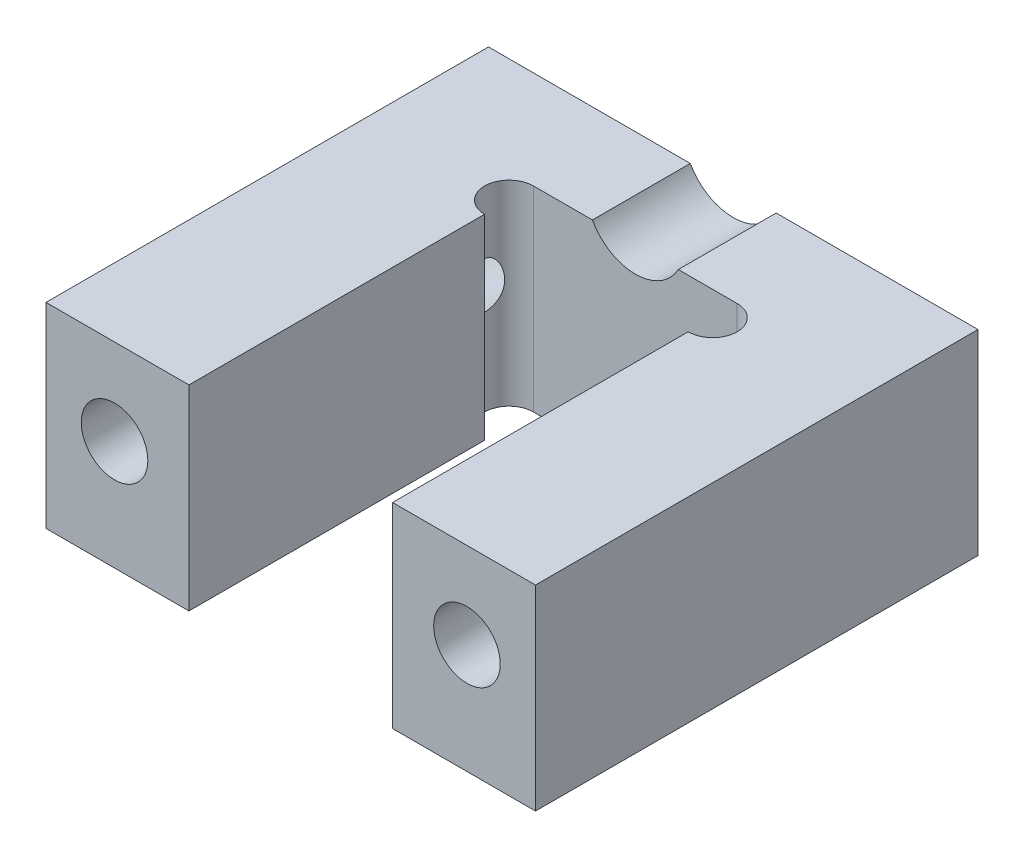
ISO-10303-21;
HEADER;
FILE_DESCRIPTION(('STEP AP214'),'2;1');
FILE_NAME('part.step','',(''),(''),'','','');
FILE_SCHEMA(('AUTOMOTIVE_DESIGN { 1 0 10303 214 1 1 1 1 }'));
ENDSEC;
DATA;
#1=APPLICATION_CONTEXT('core data for automotive mechanical design processes');
#2=APPLICATION_PROTOCOL_DEFINITION('international standard','automotive_design',2000,#1);
#3=PRODUCT_CONTEXT('',#1,'mechanical');
#4=PRODUCT('Part','Part','',(#3));
#5=PRODUCT_RELATED_PRODUCT_CATEGORY('part','',(#4));
#6=PRODUCT_DEFINITION_FORMATION('','',#4);
#7=PRODUCT_DEFINITION_CONTEXT('part definition',#1,'design');
#8=PRODUCT_DEFINITION('design','',#6,#7);
#9=PRODUCT_DEFINITION_SHAPE('','',#8);
#10=(LENGTH_UNIT() NAMED_UNIT(*) SI_UNIT(.MILLI.,.METRE.));
#11=(NAMED_UNIT(*) PLANE_ANGLE_UNIT() SI_UNIT($,.RADIAN.));
#12=(NAMED_UNIT(*) SI_UNIT($,.STERADIAN.) SOLID_ANGLE_UNIT());
#13=UNCERTAINTY_MEASURE_WITH_UNIT(LENGTH_MEASURE(1.E-05),#10,'distance_accuracy_value','');
#14=(GEOMETRIC_REPRESENTATION_CONTEXT(3) GLOBAL_UNCERTAINTY_ASSIGNED_CONTEXT((#13)) GLOBAL_UNIT_ASSIGNED_CONTEXT((#10,
#11,#12)) REPRESENTATION_CONTEXT('',''));
#15=CARTESIAN_POINT('',(0.,0.,0.));
#16=DIRECTION('',(0.,0.,1.));
#17=DIRECTION('',(1.,0.,0.));
#18=AXIS2_PLACEMENT_3D('',#15,#16,#17);
#19=CARTESIAN_POINT('',(0.,12.7,28.702));
#20=DIRECTION('',(0.,-1.,0.));
#21=DIRECTION('',(0.,0.,-1.));
#22=AXIS2_PLACEMENT_3D('',#19,#20,#21);
#23=PLANE('',#22);
#24=DIRECTION('',(-1.,0.,0.));
#25=VECTOR('',#24,1.);
#26=CARTESIAN_POINT('',(9.27099999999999,12.7,6.34999999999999));
#27=LINE('',#26,#25);
#28=CARTESIAN_POINT('',(13.0896725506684,12.7,6.34999999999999));
#29=VERTEX_POINT('',#28);
#30=CARTESIAN_POINT('',(9.27099999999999,12.7,6.34999999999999));
#31=VERTEX_POINT('',#30);
#32=EDGE_CURVE('E274',#29,#31,#27,.T.);
#33=ORIENTED_EDGE('',*,*,#32,.F.);
#34=DIRECTION('',(0.,0.,-1.));
#35=VECTOR('',#34,1.);
#36=CARTESIAN_POINT('',(13.0896725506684,12.7,12.7));
#37=LINE('',#36,#35);
#38=CARTESIAN_POINT('',(13.0896725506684,12.7,0.));
#39=VERTEX_POINT('',#38);
#40=EDGE_CURVE('E49',#29,#39,#37,.T.);
#41=ORIENTED_EDGE('',*,*,#40,.T.);
#42=DIRECTION('',(-1.,0.,0.));
#43=VECTOR('',#42,1.);
#44=CARTESIAN_POINT('',(0.,12.7,0.));
#45=LINE('',#44,#43);
#46=CARTESIAN_POINT('',(0.,12.7,0.));
#47=VERTEX_POINT('',#46);
#48=EDGE_CURVE('E139',#39,#47,#45,.T.);
#49=ORIENTED_EDGE('',*,*,#48,.T.);
#50=DIRECTION('',(0.,0.,-1.));
#51=VECTOR('',#50,1.);
#52=CARTESIAN_POINT('',(0.,12.7,28.702));
#53=LINE('',#52,#51);
#54=CARTESIAN_POINT('',(0.,12.7,28.702));
#55=VERTEX_POINT('',#54);
#56=EDGE_CURVE('E164',#55,#47,#53,.T.);
#57=ORIENTED_EDGE('',*,*,#56,.F.);
#58=DIRECTION('',(-1.,0.,0.));
#59=VECTOR('',#58,1.);
#60=CARTESIAN_POINT('',(0.,12.7,28.702));
#61=LINE('',#60,#59);
#62=CARTESIAN_POINT('',(9.271,12.7,28.702));
#63=VERTEX_POINT('',#62);
#64=EDGE_CURVE('E160',#63,#55,#61,.T.);
#65=ORIENTED_EDGE('',*,*,#64,.F.);
#66=DIRECTION('',(0.,0.,1.));
#67=VECTOR('',#66,1.);
#68=CARTESIAN_POINT('',(9.27099999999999,12.7,6.34999999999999));
#69=LINE('',#68,#67);
#70=CARTESIAN_POINT('',(9.27099999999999,12.7,9.525));
#71=VERTEX_POINT('',#70);
#72=EDGE_CURVE('E56',#71,#63,#69,.T.);
#73=ORIENTED_EDGE('',*,*,#72,.F.);
#74=CARTESIAN_POINT('',(9.27099999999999,12.7,7.93749999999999));
#75=DIRECTION('',(0.,1.,0.));
#76=DIRECTION('',(0.,0.,-1.));
#77=AXIS2_PLACEMENT_3D('',#74,#75,#76);
#78=CIRCLE('',#77,1.5875);
#79=EDGE_CURVE('E302',#31,#71,#78,.T.);
#80=ORIENTED_EDGE('',*,*,#79,.F.);
#81=EDGE_LOOP('',(#33,#41,#49,#57,#65,#73,#80));
#82=FACE_BOUND('',#81,.T.);
#83=ADVANCED_FACE('F34',(#82),#23,.F.);
#84=CARTESIAN_POINT('',(4.445,7.112,28.702));
#85=DIRECTION('',(0.,0.,-1.));
#86=DIRECTION('',(-1.,0.,0.));
#87=AXIS2_PLACEMENT_3D('',#84,#85,#86);
#88=CYLINDRICAL_SURFACE('',#87,2.159);
#89=CARTESIAN_POINT('',(4.445,7.112,28.702));
#90=DIRECTION('',(0.,0.,-1.));
#91=DIRECTION('',(1.,0.,0.));
#92=AXIS2_PLACEMENT_3D('',#89,#90,#91);
#93=CIRCLE('',#92,2.159);
#94=CARTESIAN_POINT('',(6.604,7.112,28.702));
#95=VERTEX_POINT('',#94);
#96=EDGE_CURVE('E176',#95,#95,#93,.T.);
#97=ORIENTED_EDGE('',*,*,#96,.F.);
#98=EDGE_LOOP('',(#97));
#99=FACE_BOUND('',#98,.T.);
#100=CARTESIAN_POINT('',(4.445,7.112,17.78));
#101=DIRECTION('',(0.,0.,-1.));
#102=DIRECTION('',(-1.,0.,0.));
#103=AXIS2_PLACEMENT_3D('',#100,#101,#102);
#104=CIRCLE('',#103,2.159);
#105=CARTESIAN_POINT('',(2.286,7.112,17.78));
#106=VERTEX_POINT('',#105);
#107=EDGE_CURVE('E178',#106,#106,#104,.F.);
#108=ORIENTED_EDGE('',*,*,#107,.F.);
#109=EDGE_LOOP('',(#108));
#110=FACE_BOUND('',#109,.T.);
#111=ADVANCED_FACE('F222',(#99,#110),#88,.F.);
#112=CARTESIAN_POINT('',(27.305,7.112,28.702));
#113=DIRECTION('',(0.,0.,-1.));
#114=DIRECTION('',(-1.,0.,0.));
#115=AXIS2_PLACEMENT_3D('',#112,#113,#114);
#116=CYLINDRICAL_SURFACE('',#115,2.159);
#117=CARTESIAN_POINT('',(27.305,7.112,28.702));
#118=DIRECTION('',(0.,0.,-1.));
#119=DIRECTION('',(-1.,0.,0.));
#120=AXIS2_PLACEMENT_3D('',#117,#118,#119);
#121=CIRCLE('',#120,2.159);
#122=CARTESIAN_POINT('',(25.146,7.112,28.702));
#123=VERTEX_POINT('',#122);
#124=EDGE_CURVE('E280',#123,#123,#121,.T.);
#125=ORIENTED_EDGE('',*,*,#124,.F.);
#126=EDGE_LOOP('',(#125));
#127=FACE_BOUND('',#126,.T.);
#128=CARTESIAN_POINT('',(27.305,7.112,17.78));
#129=DIRECTION('',(0.,0.,-1.));
#130=DIRECTION('',(-1.,0.,0.));
#131=AXIS2_PLACEMENT_3D('',#128,#129,#130);
#132=CIRCLE('',#131,2.159);
#133=CARTESIAN_POINT('',(25.146,7.112,17.78));
#134=VERTEX_POINT('',#133);
#135=EDGE_CURVE('E173',#134,#134,#132,.F.);
#136=ORIENTED_EDGE('',*,*,#135,.F.);
#137=EDGE_LOOP('',(#136));
#138=FACE_BOUND('',#137,.T.);
#139=ADVANCED_FACE('F228',(#127,#138),#116,.F.);
#140=CARTESIAN_POINT('',(0.,12.7,28.702));
#141=DIRECTION('',(0.,0.,-1.));
#142=DIRECTION('',(-1.,0.,0.));
#143=AXIS2_PLACEMENT_3D('',#140,#141,#142);
#144=PLANE('',#143);
#145=ORIENTED_EDGE('',*,*,#124,.T.);
#146=EDGE_LOOP('',(#145));
#147=FACE_BOUND('',#146,.T.);
#148=CARTESIAN_POINT('',(31.75,12.7,28.702));
#149=VERTEX_POINT('',#148);
#150=CARTESIAN_POINT('',(22.479,12.7,28.702));
#151=VERTEX_POINT('',#150);
#152=EDGE_CURVE('E161',#149,#151,#61,.T.);
#153=ORIENTED_EDGE('',*,*,#152,.T.);
#154=DIRECTION('',(0.,1.,0.));
#155=VECTOR('',#154,1.);
#156=CARTESIAN_POINT('',(22.479,12.7,28.702));
#157=LINE('',#156,#155);
#158=CARTESIAN_POINT('',(22.479,0.,28.702));
#159=VERTEX_POINT('',#158);
#160=EDGE_CURVE('E275',#159,#151,#157,.T.);
#161=ORIENTED_EDGE('',*,*,#160,.F.);
#162=DIRECTION('',(1.,0.,0.));
#163=VECTOR('',#162,1.);
#164=CARTESIAN_POINT('',(0.,0.,28.702));
#165=LINE('',#164,#163);
#166=CARTESIAN_POINT('',(31.75,0.,28.702));
#167=VERTEX_POINT('',#166);
#168=EDGE_CURVE('E149',#159,#167,#165,.T.);
#169=ORIENTED_EDGE('',*,*,#168,.T.);
#170=DIRECTION('',(0.,1.,0.));
#171=VECTOR('',#170,1.);
#172=CARTESIAN_POINT('',(31.75,0.,28.702));
#173=LINE('',#172,#171);
#174=EDGE_CURVE('E158',#167,#149,#173,.T.);
#175=ORIENTED_EDGE('',*,*,#174,.T.);
#176=EDGE_LOOP('',(#153,#161,#169,#175));
#177=FACE_BOUND('',#176,.T.);
#178=ADVANCED_FACE('F242',(#147,#177),#144,.F.);
#179=CARTESIAN_POINT('',(0.,0.,28.702));
#180=DIRECTION('',(1.,0.,0.));
#181=DIRECTION('',(0.,1.,0.));
#182=AXIS2_PLACEMENT_3D('',#179,#180,#181);
#183=PLANE('',#182);
#184=DIRECTION('',(0.,-1.,0.));
#185=VECTOR('',#184,1.);
#186=CARTESIAN_POINT('',(0.,0.,0.));
#187=LINE('',#186,#185);
#188=CARTESIAN_POINT('',(0.,0.,0.));
#189=VERTEX_POINT('',#188);
#190=EDGE_CURVE('E252',#47,#189,#187,.T.);
#191=ORIENTED_EDGE('',*,*,#190,.T.);
#192=DIRECTION('',(0.,0.,-1.));
#193=VECTOR('',#192,1.);
#194=CARTESIAN_POINT('',(0.,0.,28.702));
#195=LINE('',#194,#193);
#196=CARTESIAN_POINT('',(0.,0.,28.702));
#197=VERTEX_POINT('',#196);
#198=EDGE_CURVE('E42',#197,#189,#195,.T.);
#199=ORIENTED_EDGE('',*,*,#198,.F.);
#200=DIRECTION('',(0.,-1.,0.));
#201=VECTOR('',#200,1.);
#202=CARTESIAN_POINT('',(0.,0.,28.702));
#203=LINE('',#202,#201);
#204=EDGE_CURVE('E146',#55,#197,#203,.T.);
#205=ORIENTED_EDGE('',*,*,#204,.F.);
#206=ORIENTED_EDGE('',*,*,#56,.T.);
#207=EDGE_LOOP('',(#191,#199,#205,#206));
#208=FACE_BOUND('',#207,.T.);
#209=ADVANCED_FACE('F36',(#208),#183,.F.);
#210=CARTESIAN_POINT('',(0.,0.,28.702));
#211=DIRECTION('',(0.,1.,0.));
#212=DIRECTION('',(0.,0.,1.));
#213=AXIS2_PLACEMENT_3D('',#210,#211,#212);
#214=PLANE('',#213);
#215=DIRECTION('',(0.,0.,1.));
#216=VECTOR('',#215,1.);
#217=CARTESIAN_POINT('',(22.479,0.,6.34999999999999));
#218=LINE('',#217,#216);
#219=CARTESIAN_POINT('',(22.479,0.,9.52499999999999));
#220=VERTEX_POINT('',#219);
#221=EDGE_CURVE('E261',#220,#159,#218,.T.);
#222=ORIENTED_EDGE('',*,*,#221,.F.);
#223=CARTESIAN_POINT('',(22.479,0.,7.93749999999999));
#224=DIRECTION('',(0.,1.,0.));
#225=DIRECTION('',(0.,0.,1.));
#226=AXIS2_PLACEMENT_3D('',#223,#224,#225);
#227=CIRCLE('',#226,1.5875);
#228=CARTESIAN_POINT('',(22.479,0.,6.34999999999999));
#229=VERTEX_POINT('',#228);
#230=EDGE_CURVE('E299',#220,#229,#227,.T.);
#231=ORIENTED_EDGE('',*,*,#230,.T.);
#232=DIRECTION('',(1.,0.,0.));
#233=VECTOR('',#232,1.);
#234=CARTESIAN_POINT('',(9.271,0.,6.34999999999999));
#235=LINE('',#234,#233);
#236=CARTESIAN_POINT('',(9.271,0.,6.34999999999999));
#237=VERTEX_POINT('',#236);
#238=EDGE_CURVE('E266',#237,#229,#235,.T.);
#239=ORIENTED_EDGE('',*,*,#238,.F.);
#240=CARTESIAN_POINT('',(9.27099999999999,0.,7.93749999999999));
#241=DIRECTION('',(0.,1.,0.));
#242=DIRECTION('',(0.,0.,-1.));
#243=AXIS2_PLACEMENT_3D('',#240,#241,#242);
#244=CIRCLE('',#243,1.5875);
#245=CARTESIAN_POINT('',(9.27099999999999,0.,9.525));
#246=VERTEX_POINT('',#245);
#247=EDGE_CURVE('E295',#237,#246,#244,.T.);
#248=ORIENTED_EDGE('',*,*,#247,.T.);
#249=DIRECTION('',(0.,0.,1.));
#250=VECTOR('',#249,1.);
#251=CARTESIAN_POINT('',(9.271,0.,6.34999999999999));
#252=LINE('',#251,#250);
#253=CARTESIAN_POINT('',(9.271,0.,28.702));
#254=VERTEX_POINT('',#253);
#255=EDGE_CURVE('E258',#246,#254,#252,.T.);
#256=ORIENTED_EDGE('',*,*,#255,.T.);
#257=EDGE_CURVE('E155',#197,#254,#165,.T.);
#258=ORIENTED_EDGE('',*,*,#257,.F.);
#259=ORIENTED_EDGE('',*,*,#198,.T.);
#260=DIRECTION('',(1.,0.,0.));
#261=VECTOR('',#260,1.);
#262=CARTESIAN_POINT('',(0.,0.,0.));
#263=LINE('',#262,#261);
#264=CARTESIAN_POINT('',(31.75,0.,0.));
#265=VERTEX_POINT('',#264);
#266=EDGE_CURVE('E251',#189,#265,#263,.T.);
#267=ORIENTED_EDGE('',*,*,#266,.T.);
#268=DIRECTION('',(0.,0.,-1.));
#269=VECTOR('',#268,1.);
#270=CARTESIAN_POINT('',(31.75,0.,28.702));
#271=LINE('',#270,#269);
#272=EDGE_CURVE('E168',#167,#265,#271,.T.);
#273=ORIENTED_EDGE('',*,*,#272,.F.);
#274=ORIENTED_EDGE('',*,*,#168,.F.);
#275=EDGE_LOOP('',(#222,#231,#239,#248,#256,#258,#259,#267,#273,#274));
#276=FACE_BOUND('',#275,.T.);
#277=ADVANCED_FACE('F243',(#276),#214,.F.);
#278=CARTESIAN_POINT('',(31.75,0.,28.702));
#279=DIRECTION('',(-1.,0.,0.));
#280=DIRECTION('',(0.,-1.,0.));
#281=AXIS2_PLACEMENT_3D('',#278,#279,#280);
#282=PLANE('',#281);
#283=DIRECTION('',(0.,1.,0.));
#284=VECTOR('',#283,1.);
#285=CARTESIAN_POINT('',(31.75,0.,0.));
#286=LINE('',#285,#284);
#287=CARTESIAN_POINT('',(31.75,12.7,0.));
#288=VERTEX_POINT('',#287);
#289=EDGE_CURVE('E151',#265,#288,#286,.T.);
#290=ORIENTED_EDGE('',*,*,#289,.T.);
#291=DIRECTION('',(0.,0.,-1.));
#292=VECTOR('',#291,1.);
#293=CARTESIAN_POINT('',(31.75,12.7,28.702));
#294=LINE('',#293,#292);
#295=EDGE_CURVE('E145',#149,#288,#294,.T.);
#296=ORIENTED_EDGE('',*,*,#295,.F.);
#297=ORIENTED_EDGE('',*,*,#174,.F.);
#298=ORIENTED_EDGE('',*,*,#272,.T.);
#299=EDGE_LOOP('',(#290,#296,#297,#298));
#300=FACE_BOUND('',#299,.T.);
#301=ADVANCED_FACE('F236',(#300),#282,.F.);
#302=CARTESIAN_POINT('',(18.6603274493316,12.7,0.));
#303=VERTEX_POINT('',#302);
#304=EDGE_CURVE('E137',#288,#303,#45,.T.);
#305=ORIENTED_EDGE('',*,*,#304,.T.);
#306=DIRECTION('',(0.,0.,-1.));
#307=VECTOR('',#306,1.);
#308=CARTESIAN_POINT('',(18.6603274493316,12.7,12.7));
#309=LINE('',#308,#307);
#310=CARTESIAN_POINT('',(18.6603274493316,12.7,6.34999999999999));
#311=VERTEX_POINT('',#310);
#312=EDGE_CURVE('E122',#303,#311,#309,.F.);
#313=ORIENTED_EDGE('',*,*,#312,.T.);
#314=CARTESIAN_POINT('',(22.479,12.7,6.34999999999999));
#315=VERTEX_POINT('',#314);
#316=EDGE_CURVE('E272',#315,#311,#27,.T.);
#317=ORIENTED_EDGE('',*,*,#316,.F.);
#318=CARTESIAN_POINT('',(22.479,12.7,7.93749999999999));
#319=DIRECTION('',(0.,1.,0.));
#320=DIRECTION('',(0.,0.,1.));
#321=AXIS2_PLACEMENT_3D('',#318,#319,#320);
#322=CIRCLE('',#321,1.5875);
#323=CARTESIAN_POINT('',(22.479,12.7,9.52499999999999));
#324=VERTEX_POINT('',#323);
#325=EDGE_CURVE('E304',#324,#315,#322,.T.);
#326=ORIENTED_EDGE('',*,*,#325,.F.);
#327=DIRECTION('',(0.,0.,1.));
#328=VECTOR('',#327,1.);
#329=CARTESIAN_POINT('',(22.479,12.7,6.34999999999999));
#330=LINE('',#329,#328);
#331=EDGE_CURVE('E254',#324,#151,#330,.T.);
#332=ORIENTED_EDGE('',*,*,#331,.T.);
#333=ORIENTED_EDGE('',*,*,#152,.F.);
#334=ORIENTED_EDGE('',*,*,#295,.T.);
#335=EDGE_LOOP('',(#305,#313,#317,#326,#332,#333,#334));
#336=FACE_BOUND('',#335,.T.);
#337=ADVANCED_FACE('F142',(#336),#23,.F.);
#338=ORIENTED_EDGE('',*,*,#96,.T.);
#339=EDGE_LOOP('',(#338));
#340=FACE_BOUND('',#339,.T.);
#341=ORIENTED_EDGE('',*,*,#257,.T.);
#342=DIRECTION('',(0.,-1.,0.));
#343=VECTOR('',#342,1.);
#344=CARTESIAN_POINT('',(9.27099999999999,12.7,28.702));
#345=LINE('',#344,#343);
#346=EDGE_CURVE('E278',#63,#254,#345,.T.);
#347=ORIENTED_EDGE('',*,*,#346,.F.);
#348=ORIENTED_EDGE('',*,*,#64,.T.);
#349=ORIENTED_EDGE('',*,*,#204,.T.);
#350=EDGE_LOOP('',(#341,#347,#348,#349));
#351=FACE_BOUND('',#350,.T.);
#352=ADVANCED_FACE('F235',(#340,#351),#144,.F.);
#353=CARTESIAN_POINT('',(0.,12.7,0.));
#354=DIRECTION('',(0.,0.,-1.));
#355=DIRECTION('',(-1.,0.,0.));
#356=AXIS2_PLACEMENT_3D('',#353,#354,#355);
#357=PLANE('',#356);
#358=CARTESIAN_POINT('',(15.875,14.224,0.));
#359=DIRECTION('',(0.,0.,-1.));
#360=DIRECTION('',(-1.,0.,0.));
#361=AXIS2_PLACEMENT_3D('',#358,#359,#360);
#362=CIRCLE('',#361,3.175);
#363=EDGE_CURVE('E125',#303,#39,#362,.T.);
#364=ORIENTED_EDGE('',*,*,#363,.F.);
#365=ORIENTED_EDGE('',*,*,#304,.F.);
#366=ORIENTED_EDGE('',*,*,#289,.F.);
#367=ORIENTED_EDGE('',*,*,#266,.F.);
#368=ORIENTED_EDGE('',*,*,#190,.F.);
#369=ORIENTED_EDGE('',*,*,#48,.F.);
#370=EDGE_LOOP('',(#364,#365,#366,#367,#368,#369));
#371=FACE_BOUND('',#370,.T.);
#372=CARTESIAN_POINT('',(4.445,7.112,0.));
#373=DIRECTION('',(0.,0.,-1.));
#374=DIRECTION('',(-1.,0.,0.));
#375=AXIS2_PLACEMENT_3D('',#372,#373,#374);
#376=CIRCLE('',#375,3.5687);
#377=CARTESIAN_POINT('',(0.876300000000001,7.112,0.));
#378=VERTEX_POINT('',#377);
#379=EDGE_CURVE('E290',#378,#378,#376,.T.);
#380=ORIENTED_EDGE('',*,*,#379,.F.);
#381=EDGE_LOOP('',(#380));
#382=FACE_BOUND('',#381,.T.);
#383=CARTESIAN_POINT('',(27.305,7.112,0.));
#384=DIRECTION('',(0.,0.,-1.));
#385=DIRECTION('',(-1.,0.,0.));
#386=AXIS2_PLACEMENT_3D('',#383,#384,#385);
#387=CIRCLE('',#386,3.5687);
#388=CARTESIAN_POINT('',(23.7363,7.112,0.));
#389=VERTEX_POINT('',#388);
#390=EDGE_CURVE('E181',#389,#389,#387,.T.);
#391=ORIENTED_EDGE('',*,*,#390,.F.);
#392=EDGE_LOOP('',(#391));
#393=FACE_BOUND('',#392,.T.);
#394=ADVANCED_FACE('F134',(#371,#382,#393),#357,.T.);
#395=CARTESIAN_POINT('',(22.479,12.7,6.34999999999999));
#396=DIRECTION('',(1.,0.,0.));
#397=DIRECTION('',(0.,0.,-1.));
#398=AXIS2_PLACEMENT_3D('',#395,#396,#397);
#399=PLANE('',#398);
#400=ORIENTED_EDGE('',*,*,#331,.F.);
#401=DIRECTION('',(0.,1.,0.));
#402=VECTOR('',#401,1.);
#403=CARTESIAN_POINT('',(22.479,0.,9.52499999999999));
#404=LINE('',#403,#402);
#405=EDGE_CURVE('E190',#220,#324,#404,.T.);
#406=ORIENTED_EDGE('',*,*,#405,.F.);
#407=ORIENTED_EDGE('',*,*,#221,.T.);
#408=ORIENTED_EDGE('',*,*,#160,.T.);
#409=EDGE_LOOP('',(#400,#406,#407,#408));
#410=FACE_BOUND('',#409,.T.);
#411=ADVANCED_FACE('F335',(#410),#399,.F.);
#412=CARTESIAN_POINT('',(9.27099999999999,12.7,6.34999999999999));
#413=DIRECTION('',(-1.,0.,0.));
#414=DIRECTION('',(0.,-1.,0.));
#415=AXIS2_PLACEMENT_3D('',#412,#413,#414);
#416=PLANE('',#415);
#417=ORIENTED_EDGE('',*,*,#255,.F.);
#418=DIRECTION('',(0.,1.,0.));
#419=VECTOR('',#418,1.);
#420=CARTESIAN_POINT('',(9.27099999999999,0.,9.525));
#421=LINE('',#420,#419);
#422=EDGE_CURVE('E293',#246,#71,#421,.T.);
#423=ORIENTED_EDGE('',*,*,#422,.T.);
#424=ORIENTED_EDGE('',*,*,#72,.T.);
#425=ORIENTED_EDGE('',*,*,#346,.T.);
#426=EDGE_LOOP('',(#417,#423,#424,#425));
#427=FACE_BOUND('',#426,.T.);
#428=ADVANCED_FACE('F315',(#427),#416,.F.);
#429=CARTESIAN_POINT('',(22.479,12.7,6.34999999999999));
#430=DIRECTION('',(0.,0.,-1.));
#431=DIRECTION('',(-1.,0.,0.));
#432=AXIS2_PLACEMENT_3D('',#429,#430,#431);
#433=PLANE('',#432);
#434=ORIENTED_EDGE('',*,*,#316,.T.);
#435=CARTESIAN_POINT('',(15.875,14.224,6.34999999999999));
#436=DIRECTION('',(0.,0.,-1.));
#437=DIRECTION('',(-1.,0.,0.));
#438=AXIS2_PLACEMENT_3D('',#435,#436,#437);
#439=CIRCLE('',#438,3.175);
#440=EDGE_CURVE('E11',#311,#29,#439,.T.);
#441=ORIENTED_EDGE('',*,*,#440,.T.);
#442=ORIENTED_EDGE('',*,*,#32,.T.);
#443=DIRECTION('',(0.,-1.,0.));
#444=VECTOR('',#443,1.);
#445=CARTESIAN_POINT('',(9.27099999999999,12.7,6.34999999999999));
#446=LINE('',#445,#444);
#447=EDGE_CURVE('E269',#31,#237,#446,.T.);
#448=ORIENTED_EDGE('',*,*,#447,.T.);
#449=ORIENTED_EDGE('',*,*,#238,.T.);
#450=DIRECTION('',(0.,1.,0.));
#451=VECTOR('',#450,1.);
#452=CARTESIAN_POINT('',(22.479,12.7,6.34999999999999));
#453=LINE('',#452,#451);
#454=EDGE_CURVE('E259',#229,#315,#453,.T.);
#455=ORIENTED_EDGE('',*,*,#454,.T.);
#456=EDGE_LOOP('',(#434,#441,#442,#448,#449,#455));
#457=FACE_BOUND('',#456,.T.);
#458=ADVANCED_FACE('F310',(#457),#433,.F.);
#459=CARTESIAN_POINT('',(27.305,7.112,17.78));
#460=DIRECTION('',(0.,0.,-1.));
#461=DIRECTION('',(-1.,0.,0.));
#462=AXIS2_PLACEMENT_3D('',#459,#460,#461);
#463=PLANE('',#462);
#464=CARTESIAN_POINT('',(27.305,7.112,17.78));
#465=DIRECTION('',(0.,0.,-1.));
#466=DIRECTION('',(-1.,0.,0.));
#467=AXIS2_PLACEMENT_3D('',#464,#465,#466);
#468=CIRCLE('',#467,3.5687);
#469=CARTESIAN_POINT('',(23.7363,7.112,17.78));
#470=VERTEX_POINT('',#469);
#471=EDGE_CURVE('E177',#470,#470,#468,.T.);
#472=ORIENTED_EDGE('',*,*,#471,.T.);
#473=EDGE_LOOP('',(#472));
#474=FACE_BOUND('',#473,.T.);
#475=ORIENTED_EDGE('',*,*,#135,.T.);
#476=EDGE_LOOP('',(#475));
#477=FACE_BOUND('',#476,.T.);
#478=ADVANCED_FACE('F217',(#474,#477),#463,.T.);
#479=CARTESIAN_POINT('',(27.305,7.112,17.78));
#480=DIRECTION('',(0.,0.,-1.));
#481=DIRECTION('',(-1.,0.,0.));
#482=AXIS2_PLACEMENT_3D('',#479,#480,#481);
#483=CYLINDRICAL_SURFACE('',#482,3.5687);
#484=CARTESIAN_POINT('',(23.7363,7.112,8.90670222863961));
#485=CARTESIAN_POINT('',(23.7363000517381,7.16817267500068,8.90670256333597));
#486=CARTESIAN_POINT('',(23.7376285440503,7.22435730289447,8.90498624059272));
#487=CARTESIAN_POINT('',(23.7429198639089,7.33639001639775,8.89806316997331));
#488=CARTESIAN_POINT('',(23.7468830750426,7.39223805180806,8.89285591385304));
#489=CARTESIAN_POINT('',(23.7573827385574,7.50334249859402,8.87876091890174));
#490=CARTESIAN_POINT('',(23.7639241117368,7.55859756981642,8.86986614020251));
#491=CARTESIAN_POINT('',(23.7794366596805,7.66794358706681,8.84810284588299));
#492=CARTESIAN_POINT('',(23.7884066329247,7.72203509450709,8.83523629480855));
#493=CARTESIAN_POINT('',(23.812658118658,7.85021568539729,8.79899501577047));
#494=CARTESIAN_POINT('',(23.8290239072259,7.92351658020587,8.77347486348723));
#495=CARTESIAN_POINT('',(23.8650762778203,8.06479876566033,8.71223329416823));
#496=CARTESIAN_POINT('',(23.8847550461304,8.13279203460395,8.67653574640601));
#497=CARTESIAN_POINT('',(23.9196856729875,8.24229959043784,8.60508540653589));
#498=CARTESIAN_POINT('',(23.9345948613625,8.28582688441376,8.57226569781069));
#499=CARTESIAN_POINT('',(23.9640273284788,8.36714134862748,8.49996700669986));
#500=CARTESIAN_POINT('',(23.9785511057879,8.40493626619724,8.46049716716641));
#501=CARTESIAN_POINT('',(24.0028214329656,8.4655394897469,8.38400674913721));
#502=CARTESIAN_POINT('',(24.0129246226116,8.48982361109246,8.34827515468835));
#503=CARTESIAN_POINT('',(24.0311307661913,8.53254200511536,8.27297355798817));
#504=CARTESIAN_POINT('',(24.0392347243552,8.55097921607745,8.23340549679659));
#505=CARTESIAN_POINT('',(24.0526493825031,8.58105174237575,8.15090330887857));
#506=CARTESIAN_POINT('',(24.0579368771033,8.5926306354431,8.10794446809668));
#507=CARTESIAN_POINT('',(24.0649422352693,8.60790112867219,8.02036406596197));
#508=CARTESIAN_POINT('',(24.0666628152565,8.6115987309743,7.97574379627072));
#509=CARTESIAN_POINT('',(24.0663351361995,8.6108882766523,7.89248837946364));
#510=CARTESIAN_POINT('',(24.0647532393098,8.60748327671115,7.85383866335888));
#511=CARTESIAN_POINT('',(24.0589025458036,8.59474060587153,7.77775129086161));
#512=CARTESIAN_POINT('',(24.0546339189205,8.58540330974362,7.74031355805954));
#513=CARTESIAN_POINT('',(24.0438681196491,8.56141606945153,7.66791882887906));
#514=CARTESIAN_POINT('',(24.0373908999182,8.54681362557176,7.63294289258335));
#515=CARTESIAN_POINT('',(24.022736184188,8.51296555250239,7.56571950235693));
#516=CARTESIAN_POINT('',(24.014557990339,8.49371801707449,7.53347317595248));
#517=CARTESIAN_POINT('',(23.9932176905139,8.44196197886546,7.45852572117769));
#518=CARTESIAN_POINT('',(23.9794442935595,8.40734220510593,7.41745384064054));
#519=CARTESIAN_POINT('',(23.9510443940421,8.33193261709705,7.34177914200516));
#520=CARTESIAN_POINT('',(23.9364161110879,8.29112962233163,7.30719050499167));
#521=CARTESIAN_POINT('',(23.9014345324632,8.18693725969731,7.23090887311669));
#522=CARTESIAN_POINT('',(23.8812479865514,8.12124295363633,7.19230277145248));
#523=CARTESIAN_POINT('',(23.8437318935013,7.98397389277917,7.12563353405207));
#524=CARTESIAN_POINT('',(23.8264077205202,7.91238844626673,7.09759010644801));
#525=CARTESIAN_POINT('',(23.8003940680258,7.78738541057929,7.05746849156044));
#526=CARTESIAN_POINT('',(23.7906681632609,7.73488542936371,7.04312228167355));
#527=CARTESIAN_POINT('',(23.7734755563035,7.62858288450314,7.01841696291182));
#528=CARTESIAN_POINT('',(23.7660097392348,7.57477981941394,7.00805941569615));
#529=CARTESIAN_POINT('',(23.7472620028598,7.41202952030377,6.98243744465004));
#530=CARTESIAN_POINT('',(23.7396332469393,7.30175746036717,6.97262859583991));
#531=CARTESIAN_POINT('',(23.7346723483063,7.0782864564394,6.9661815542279));
#532=CARTESIAN_POINT('',(23.7375603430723,6.96507476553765,6.96982496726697));
#533=CARTESIAN_POINT('',(23.7497851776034,6.79697697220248,6.98603154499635));
#534=CARTESIAN_POINT('',(23.7551756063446,6.74123093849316,6.99322399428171));
#535=CARTESIAN_POINT('',(23.7684691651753,6.63068436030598,7.01145734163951));
#536=CARTESIAN_POINT('',(23.7763714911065,6.57588351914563,7.02249700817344));
#537=CARTESIAN_POINT('',(23.7987982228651,6.44217279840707,7.05497360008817));
#538=CARTESIAN_POINT('',(23.8146886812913,6.36406085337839,7.0788585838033));
#539=CARTESIAN_POINT('',(23.8505355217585,6.21295159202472,7.13735809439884));
#540=CARTESIAN_POINT('',(23.8704849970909,6.13994586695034,7.17195444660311));
#541=CARTESIAN_POINT('',(23.9063684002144,6.02225558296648,7.24192274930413));
#542=CARTESIAN_POINT('',(23.9217725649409,5.97552849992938,7.27411474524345));
#543=CARTESIAN_POINT('',(23.9525284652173,5.88778554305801,7.34557122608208));
#544=CARTESIAN_POINT('',(23.9678802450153,5.84676093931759,7.38482468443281));
#545=CARTESIAN_POINT('',(23.9937140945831,5.78084619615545,7.46102441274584));
#546=CARTESIAN_POINT('',(24.0045156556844,5.75440154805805,7.49651007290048));
#547=CARTESIAN_POINT('',(24.0242612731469,5.70735631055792,7.57167268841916));
#548=CARTESIAN_POINT('',(24.0332061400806,5.68675316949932,7.61134780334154));
#549=CARTESIAN_POINT('',(24.0483713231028,5.65242828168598,7.69453981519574));
#550=CARTESIAN_POINT('',(24.0545662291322,5.63877054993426,7.73808825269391));
#551=CARTESIAN_POINT('',(24.0633017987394,5.61964330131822,7.82730060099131));
#552=CARTESIAN_POINT('',(24.0658460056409,5.61416584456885,7.87296241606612));
#553=CARTESIAN_POINT('',(24.0668536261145,5.61199159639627,7.95788728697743));
#554=CARTESIAN_POINT('',(24.0658548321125,5.61413769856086,7.99711900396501));
#555=CARTESIAN_POINT('',(24.0610470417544,5.62457882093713,8.07456834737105));
#556=CARTESIAN_POINT('',(24.057238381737,5.6328731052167,8.11278609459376));
#557=CARTESIAN_POINT('',(24.0473291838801,5.65483197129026,8.18616957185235));
#558=CARTESIAN_POINT('',(24.0412929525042,5.66834632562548,8.22138970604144));
#559=CARTESIAN_POINT('',(24.0274314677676,5.70009899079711,8.28923485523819));
#560=CARTESIAN_POINT('',(24.0196055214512,5.71833913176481,8.32185885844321));
#561=CARTESIAN_POINT('',(23.9992334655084,5.76720290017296,8.39698170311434));
#562=CARTESIAN_POINT('',(23.9860710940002,5.79983231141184,8.43801087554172));
#563=CARTESIAN_POINT('',(23.9587158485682,5.87124510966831,8.51389617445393));
#564=CARTESIAN_POINT('',(23.9445209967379,5.91004048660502,8.54873998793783));
#565=CARTESIAN_POINT('',(23.9104679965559,6.00905017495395,8.62560215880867));
#566=CARTESIAN_POINT('',(23.8906710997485,6.07152987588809,8.66471540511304));
#567=CARTESIAN_POINT('',(23.853471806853,6.2024739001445,8.73279328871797));
#568=CARTESIAN_POINT('',(23.8360753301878,6.27095236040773,8.76173310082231));
#569=CARTESIAN_POINT('',(23.8094545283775,6.39129787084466,8.80379501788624));
#570=CARTESIAN_POINT('',(23.799322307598,6.44223546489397,8.81907092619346));
#571=CARTESIAN_POINT('',(23.7811587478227,6.54550316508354,8.84568271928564));
#572=CARTESIAN_POINT('',(23.7731284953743,6.59783397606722,8.85701656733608));
#573=CARTESIAN_POINT('',(23.7525104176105,6.75606935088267,8.88560850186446));
#574=CARTESIAN_POINT('',(23.7433373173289,6.86347382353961,8.89754134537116));
#575=CARTESIAN_POINT('',(23.7381522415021,6.99463429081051,8.90429324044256));
#576=CARTESIAN_POINT('',(23.737458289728,7.01809088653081,8.90519746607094));
#577=CARTESIAN_POINT('',(23.7365321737,7.06503095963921,8.9064018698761));
#578=CARTESIAN_POINT('',(23.7362999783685,7.08851443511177,8.90670208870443));
#579=CARTESIAN_POINT('',(23.7363,7.112,8.90670222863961));
#580=B_SPLINE_CURVE_WITH_KNOTS('',3,(#484,#485,#486,#487,#488,#489,#490,#491,#492,#493,#494,
#495,#496,#497,#498,#499,#500,#501,#502,#503,#504,#505,#506,#507,#508,#509,#510,#511,#512,#513,
#514,#515,#516,#517,#518,#519,#520,#521,#522,#523,#524,#525,#526,#527,#528,#529,#530,#531,#532,
#533,#534,#535,#536,#537,#538,#539,#540,#541,#542,#543,#544,#545,#546,#547,#548,#549,#550,#551,
#552,#553,#554,#555,#556,#557,#558,#559,#560,#561,#562,#563,#564,#565,#566,#567,#568,#569,#570,
#571,#572,#573,#574,#575,#576,#577,#578,#579),.UNSPECIFIED.,.T.,.F.,(4,2,2,2,2,2,2,2,2,2,2,2,2,
2,2,2,2,2,2,2,2,2,2,2,2,2,2,2,2,2,2,2,2,2,2,2,2,2,2,2,2,2,2,2,2,2,2,4),(0.,0.168496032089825,
0.337016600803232,0.505860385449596,0.674620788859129,0.911834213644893,1.1484958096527,
1.31750263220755,1.48627896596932,1.61887220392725,1.75139870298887,1.88500085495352,
2.01850122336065,2.13442565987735,2.25034277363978,2.3652392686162,2.48018299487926,
2.64561507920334,2.81140490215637,3.04659396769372,3.28221970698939,3.44787446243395,
3.61359400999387,3.94508450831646,4.2835533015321,4.45278806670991,4.62196870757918,
4.87081016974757,5.11923169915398,5.2950708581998,5.47063778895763,5.60678777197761,
5.7428781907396,5.88020118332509,6.01739080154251,6.13470559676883,6.25200635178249,
6.36615646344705,6.48035084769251,6.64159582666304,6.80315827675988,7.03088145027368,
7.25915651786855,7.42135326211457,7.58363368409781,7.90737402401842,7.97782626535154,
8.04827376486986),.UNSPECIFIED.);
#581=CARTESIAN_POINT('',(23.7363,7.112,8.90670222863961));
#582=VERTEX_POINT('',#581);
#583=EDGE_CURVE('E189',#582,#582,#580,.T.);
#584=ORIENTED_EDGE('',*,*,#583,.T.);
#585=EDGE_LOOP('',(#584));
#586=FACE_BOUND('',#585,.T.);
#587=ORIENTED_EDGE('',*,*,#471,.F.);
#588=EDGE_LOOP('',(#587));
#589=FACE_BOUND('',#588,.T.);
#590=ORIENTED_EDGE('',*,*,#390,.T.);
#591=EDGE_LOOP('',(#590));
#592=FACE_BOUND('',#591,.T.);
#593=ADVANCED_FACE('F210',(#586,#589,#592),#483,.F.);
#594=CARTESIAN_POINT('',(4.445,7.112,17.78));
#595=DIRECTION('',(0.,0.,-1.));
#596=DIRECTION('',(-1.,0.,0.));
#597=AXIS2_PLACEMENT_3D('',#594,#595,#596);
#598=PLANE('',#597);
#599=CARTESIAN_POINT('',(4.445,7.112,17.78));
#600=DIRECTION('',(0.,0.,-1.));
#601=DIRECTION('',(-1.,0.,0.));
#602=AXIS2_PLACEMENT_3D('',#599,#600,#601);
#603=CIRCLE('',#602,3.5687);
#604=CARTESIAN_POINT('',(0.876300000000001,7.112,17.78));
#605=VERTEX_POINT('',#604);
#606=EDGE_CURVE('E182',#605,#605,#603,.T.);
#607=ORIENTED_EDGE('',*,*,#606,.T.);
#608=EDGE_LOOP('',(#607));
#609=FACE_BOUND('',#608,.T.);
#610=ORIENTED_EDGE('',*,*,#107,.T.);
#611=EDGE_LOOP('',(#610));
#612=FACE_BOUND('',#611,.T.);
#613=ADVANCED_FACE('F208',(#609,#612),#598,.T.);
#614=CARTESIAN_POINT('',(4.445,7.112,17.78));
#615=DIRECTION('',(0.,0.,-1.));
#616=DIRECTION('',(-1.,0.,0.));
#617=AXIS2_PLACEMENT_3D('',#614,#615,#616);
#618=CYLINDRICAL_SURFACE('',#617,3.5687);
#619=CARTESIAN_POINT('',(8.0137,7.112,8.90670222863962));
#620=CARTESIAN_POINT('',(8.01369994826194,7.05582732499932,8.90670256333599));
#621=CARTESIAN_POINT('',(8.01237145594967,6.99964269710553,8.90498624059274));
#622=CARTESIAN_POINT('',(8.00708013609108,6.88760998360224,8.89806316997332));
#623=CARTESIAN_POINT('',(8.00311692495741,6.83176194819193,8.89285591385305));
#624=CARTESIAN_POINT('',(7.99261726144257,6.72065750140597,8.87876091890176));
#625=CARTESIAN_POINT('',(7.98607588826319,6.66540243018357,8.86986614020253));
#626=CARTESIAN_POINT('',(7.97056334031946,6.55605641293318,8.848102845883));
#627=CARTESIAN_POINT('',(7.9615933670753,6.5019649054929,8.83523629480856));
#628=CARTESIAN_POINT('',(7.93734188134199,6.3737843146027,8.79899501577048));
#629=CARTESIAN_POINT('',(7.92097609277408,6.30048341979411,8.77347486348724));
#630=CARTESIAN_POINT('',(7.88492372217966,6.15920123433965,8.71223329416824));
#631=CARTESIAN_POINT('',(7.86524495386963,6.09120796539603,8.67653574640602));
#632=CARTESIAN_POINT('',(7.83031432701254,5.98170040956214,8.6050854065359));
#633=CARTESIAN_POINT('',(7.81540513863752,5.93817311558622,8.5722656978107));
#634=CARTESIAN_POINT('',(7.78597267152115,5.8568586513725,8.49996700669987));
#635=CARTESIAN_POINT('',(7.77144889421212,5.81906373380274,8.46049716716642));
#636=CARTESIAN_POINT('',(7.74717856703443,5.75846051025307,8.38400674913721));
#637=CARTESIAN_POINT('',(7.73707537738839,5.73417638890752,8.34827515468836));
#638=CARTESIAN_POINT('',(7.71886923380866,5.69145799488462,8.27297355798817));
#639=CARTESIAN_POINT('',(7.71076527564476,5.67302078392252,8.23340549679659));
#640=CARTESIAN_POINT('',(7.69735061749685,5.64294825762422,8.15090330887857));
#641=CARTESIAN_POINT('',(7.69206312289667,5.63136936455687,8.10794446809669));
#642=CARTESIAN_POINT('',(7.68505776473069,5.61609887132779,8.02036406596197));
#643=CARTESIAN_POINT('',(7.68333718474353,5.61240126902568,7.97574379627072));
#644=CARTESIAN_POINT('',(7.6836648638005,5.61311172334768,7.89248837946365));
#645=CARTESIAN_POINT('',(7.68524676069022,5.61651672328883,7.85383866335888));
#646=CARTESIAN_POINT('',(7.69109745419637,5.62925939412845,7.77775129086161));
#647=CARTESIAN_POINT('',(7.69536608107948,5.63859669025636,7.74031355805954));
#648=CARTESIAN_POINT('',(7.70613188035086,5.66258393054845,7.66791882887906));
#649=CARTESIAN_POINT('',(7.71260910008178,5.67718637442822,7.63294289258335));
#650=CARTESIAN_POINT('',(7.72726381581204,5.71103444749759,7.56571950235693));
#651=CARTESIAN_POINT('',(7.73544200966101,5.73028198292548,7.53347317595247));
#652=CARTESIAN_POINT('',(7.7567823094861,5.78203802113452,7.45852572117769));
#653=CARTESIAN_POINT('',(7.77055570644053,5.81665779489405,7.41745384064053));
#654=CARTESIAN_POINT('',(7.79895560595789,5.89206738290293,7.34177914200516));
#655=CARTESIAN_POINT('',(7.81358388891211,5.93287037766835,7.30719050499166));
#656=CARTESIAN_POINT('',(7.84856546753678,6.03706274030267,7.23090887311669));
#657=CARTESIAN_POINT('',(7.8687520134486,6.10275704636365,7.19230277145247));
#658=CARTESIAN_POINT('',(7.90626810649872,6.24002610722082,7.12563353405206));
#659=CARTESIAN_POINT('',(7.92359227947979,6.31161155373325,7.097590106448));
#660=CARTESIAN_POINT('',(7.9496059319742,6.43661458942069,7.05746849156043));
#661=CARTESIAN_POINT('',(7.95933183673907,6.48911457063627,7.04312228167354));
#662=CARTESIAN_POINT('',(7.97652444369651,6.59541711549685,7.01841696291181));
#663=CARTESIAN_POINT('',(7.98399026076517,6.64922018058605,7.00805941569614));
#664=CARTESIAN_POINT('',(8.00273799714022,6.81197047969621,6.98243744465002));
#665=CARTESIAN_POINT('',(8.01036675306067,6.92224253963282,6.9726285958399));
#666=CARTESIAN_POINT('',(8.0153276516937,7.14571354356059,6.96618155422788));
#667=CARTESIAN_POINT('',(8.01243965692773,7.25892523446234,6.96982496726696));
#668=CARTESIAN_POINT('',(8.00021482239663,7.42702302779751,6.98603154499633));
#669=CARTESIAN_POINT('',(7.99482439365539,7.48276906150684,6.9932239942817));
#670=CARTESIAN_POINT('',(7.9815308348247,7.59331563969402,7.0114573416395));
#671=CARTESIAN_POINT('',(7.9736285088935,7.64811648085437,7.02249700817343));
#672=CARTESIAN_POINT('',(7.95120177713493,7.78182720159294,7.05497360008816));
#673=CARTESIAN_POINT('',(7.93531131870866,7.85993914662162,7.07885858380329));
#674=CARTESIAN_POINT('',(7.89946447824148,8.01104840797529,7.13735809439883));
#675=CARTESIAN_POINT('',(7.87951500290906,8.08405413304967,7.1719544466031));
#676=CARTESIAN_POINT('',(7.84363159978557,8.20174441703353,7.24192274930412));
#677=CARTESIAN_POINT('',(7.82822743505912,8.24847150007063,7.27411474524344));
#678=CARTESIAN_POINT('',(7.79747153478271,8.336214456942,7.34557122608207));
#679=CARTESIAN_POINT('',(7.78211975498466,8.37723906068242,7.3848246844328));
#680=CARTESIAN_POINT('',(7.7562859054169,8.44315380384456,7.46102441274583));
#681=CARTESIAN_POINT('',(7.74548434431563,8.46959845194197,7.49651007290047));
#682=CARTESIAN_POINT('',(7.72573872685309,8.51664368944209,7.57167268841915));
#683=CARTESIAN_POINT('',(7.71679385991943,8.5372468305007,7.61134780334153));
#684=CARTESIAN_POINT('',(7.70162867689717,8.57157171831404,7.69453981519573));
#685=CARTESIAN_POINT('',(7.69543377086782,8.58522945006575,7.7380882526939));
#686=CARTESIAN_POINT('',(7.68669820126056,8.6043566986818,7.8273006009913));
#687=CARTESIAN_POINT('',(7.68415399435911,8.60983415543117,7.87296241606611));
#688=CARTESIAN_POINT('',(7.68314637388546,8.61200840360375,7.95788728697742));
#689=CARTESIAN_POINT('',(7.68414516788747,8.60986230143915,7.997119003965));
#690=CARTESIAN_POINT('',(7.68895295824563,8.59942117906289,8.07456834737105));
#691=CARTESIAN_POINT('',(7.69276161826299,8.59112689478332,8.11278609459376));
#692=CARTESIAN_POINT('',(7.70267081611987,8.56916802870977,8.18616957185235));
#693=CARTESIAN_POINT('',(7.70870704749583,8.55565367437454,8.22138970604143));
#694=CARTESIAN_POINT('',(7.72256853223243,8.52390100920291,8.28923485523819));
#695=CARTESIAN_POINT('',(7.73039447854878,8.50566086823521,8.32185885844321));
#696=CARTESIAN_POINT('',(7.75076653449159,8.45679709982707,8.39698170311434));
#697=CARTESIAN_POINT('',(7.76392890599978,8.42416768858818,8.43801087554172));
#698=CARTESIAN_POINT('',(7.79128415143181,8.35275489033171,8.51389617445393));
#699=CARTESIAN_POINT('',(7.80547900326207,8.31395951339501,8.54873998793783));
#700=CARTESIAN_POINT('',(7.83953200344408,8.21494982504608,8.62560215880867));
#701=CARTESIAN_POINT('',(7.85932890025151,8.15247012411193,8.66471540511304));
#702=CARTESIAN_POINT('',(7.89652819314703,8.02152609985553,8.73279328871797));
#703=CARTESIAN_POINT('',(7.91392466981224,7.9530476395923,8.76173310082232));
#704=CARTESIAN_POINT('',(7.94054547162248,7.83270212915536,8.80379501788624));
#705=CARTESIAN_POINT('',(7.95067769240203,7.78176453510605,8.81907092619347));
#706=CARTESIAN_POINT('',(7.96884125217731,7.67849683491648,8.84568271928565));
#707=CARTESIAN_POINT('',(7.97687150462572,7.62616602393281,8.85701656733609));
#708=CARTESIAN_POINT('',(7.99748958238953,7.46793064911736,8.88560850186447));
#709=CARTESIAN_POINT('',(8.00666268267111,7.36052617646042,8.89754134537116));
#710=CARTESIAN_POINT('',(8.01184775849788,7.22936570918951,8.90429324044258));
#711=CARTESIAN_POINT('',(8.01254171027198,7.20590911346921,8.90519746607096));
#712=CARTESIAN_POINT('',(8.01346782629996,7.1589690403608,8.90640186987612));
#713=CARTESIAN_POINT('',(8.01370002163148,7.13548556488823,8.90670208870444));
#714=CARTESIAN_POINT('',(8.0137,7.112,8.90670222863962));
#715=B_SPLINE_CURVE_WITH_KNOTS('',3,(#619,#620,#621,#622,#623,#624,#625,#626,#627,#628,#629,
#630,#631,#632,#633,#634,#635,#636,#637,#638,#639,#640,#641,#642,#643,#644,#645,#646,#647,#648,
#649,#650,#651,#652,#653,#654,#655,#656,#657,#658,#659,#660,#661,#662,#663,#664,#665,#666,#667,
#668,#669,#670,#671,#672,#673,#674,#675,#676,#677,#678,#679,#680,#681,#682,#683,#684,#685,#686,
#687,#688,#689,#690,#691,#692,#693,#694,#695,#696,#697,#698,#699,#700,#701,#702,#703,#704,#705,
#706,#707,#708,#709,#710,#711,#712,#713,#714),.UNSPECIFIED.,.T.,.F.,(4,2,2,2,2,2,2,2,2,2,2,2,2,
2,2,2,2,2,2,2,2,2,2,2,2,2,2,2,2,2,2,2,2,2,2,2,2,2,2,2,2,2,2,2,2,2,2,4),(0.,0.168496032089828,
0.337016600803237,0.505860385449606,0.67462078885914,0.911834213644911,1.14849580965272,
1.31750263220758,1.48627896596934,1.61887220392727,1.7513987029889,1.88500085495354,
2.01850122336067,2.13442565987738,2.25034277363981,2.36523926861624,2.48018299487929,
2.64561507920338,2.81140490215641,3.04659396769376,3.28221970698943,3.447874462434,
3.61359400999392,3.94508450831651,4.28355330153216,4.45278806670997,4.62196870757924,
4.87081016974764,5.11923169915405,5.29507085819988,5.47063778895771,5.60678777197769,
5.74287819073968,5.88020118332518,6.01739080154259,6.13470559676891,6.25200635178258,
6.36615646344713,6.4803508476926,6.64159582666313,6.80315827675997,7.03088145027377,
7.25915651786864,7.42135326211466,7.58363368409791,7.90737402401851,7.97782626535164,
8.04827376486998),.UNSPECIFIED.);
#716=CARTESIAN_POINT('',(8.0137,7.112,8.90670222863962));
#717=VERTEX_POINT('',#716);
#718=EDGE_CURVE('E183',#717,#717,#715,.T.);
#719=ORIENTED_EDGE('',*,*,#718,.T.);
#720=EDGE_LOOP('',(#719));
#721=FACE_BOUND('',#720,.T.);
#722=ORIENTED_EDGE('',*,*,#606,.F.);
#723=EDGE_LOOP('',(#722));
#724=FACE_BOUND('',#723,.T.);
#725=ORIENTED_EDGE('',*,*,#379,.T.);
#726=EDGE_LOOP('',(#725));
#727=FACE_BOUND('',#726,.T.);
#728=ADVANCED_FACE('F195',(#721,#724,#727),#618,.F.);
#729=CARTESIAN_POINT('',(9.27099999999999,0.,7.93749999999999));
#730=DIRECTION('',(0.,1.,0.));
#731=DIRECTION('',(0.,0.,1.));
#732=AXIS2_PLACEMENT_3D('',#729,#730,#731);
#733=CYLINDRICAL_SURFACE('',#732,1.5875);
#734=ORIENTED_EDGE('',*,*,#79,.T.);
#735=ORIENTED_EDGE('',*,*,#422,.F.);
#736=ORIENTED_EDGE('',*,*,#247,.F.);
#737=ORIENTED_EDGE('',*,*,#447,.F.);
#738=EDGE_LOOP('',(#734,#735,#736,#737));
#739=FACE_BOUND('',#738,.T.);
#740=ORIENTED_EDGE('',*,*,#718,.F.);
#741=EDGE_LOOP('',(#740));
#742=FACE_BOUND('',#741,.T.);
#743=ADVANCED_FACE('F199',(#739,#742),#733,.F.);
#744=CARTESIAN_POINT('',(22.479,0.,7.93749999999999));
#745=DIRECTION('',(0.,1.,0.));
#746=DIRECTION('',(0.,0.,1.));
#747=AXIS2_PLACEMENT_3D('',#744,#745,#746);
#748=CYLINDRICAL_SURFACE('',#747,1.5875);
#749=ORIENTED_EDGE('',*,*,#325,.T.);
#750=ORIENTED_EDGE('',*,*,#454,.F.);
#751=ORIENTED_EDGE('',*,*,#230,.F.);
#752=ORIENTED_EDGE('',*,*,#405,.T.);
#753=EDGE_LOOP('',(#749,#750,#751,#752));
#754=FACE_BOUND('',#753,.T.);
#755=ORIENTED_EDGE('',*,*,#583,.F.);
#756=EDGE_LOOP('',(#755));
#757=FACE_BOUND('',#756,.T.);
#758=ADVANCED_FACE('F203',(#754,#757),#748,.F.);
#759=CARTESIAN_POINT('',(15.875,14.224,12.7));
#760=DIRECTION('',(0.,0.,-1.));
#761=DIRECTION('',(-1.,0.,0.));
#762=AXIS2_PLACEMENT_3D('',#759,#760,#761);
#763=CYLINDRICAL_SURFACE('',#762,3.175);
#764=ORIENTED_EDGE('',*,*,#440,.F.);
#765=ORIENTED_EDGE('',*,*,#312,.F.);
#766=ORIENTED_EDGE('',*,*,#363,.T.);
#767=ORIENTED_EDGE('',*,*,#40,.F.);
#768=EDGE_LOOP('',(#764,#765,#766,#767));
#769=FACE_BOUND('',#768,.T.);
#770=ADVANCED_FACE('F124',(#769),#763,.F.);
#771=CLOSED_SHELL('',(#83,#111,#139,#178,#209,#277,#301,#337,#352,#394,#411,#428,#458,#478,#593,
#613,#728,#743,#758,#770));
#772=MANIFOLD_SOLID_BREP('B2',#771);
#773=ADVANCED_BREP_SHAPE_REPRESENTATION('',(#18,#772),#14);
#774=SHAPE_DEFINITION_REPRESENTATION(#9,#773);
ENDSEC;
END-ISO-10303-21;
